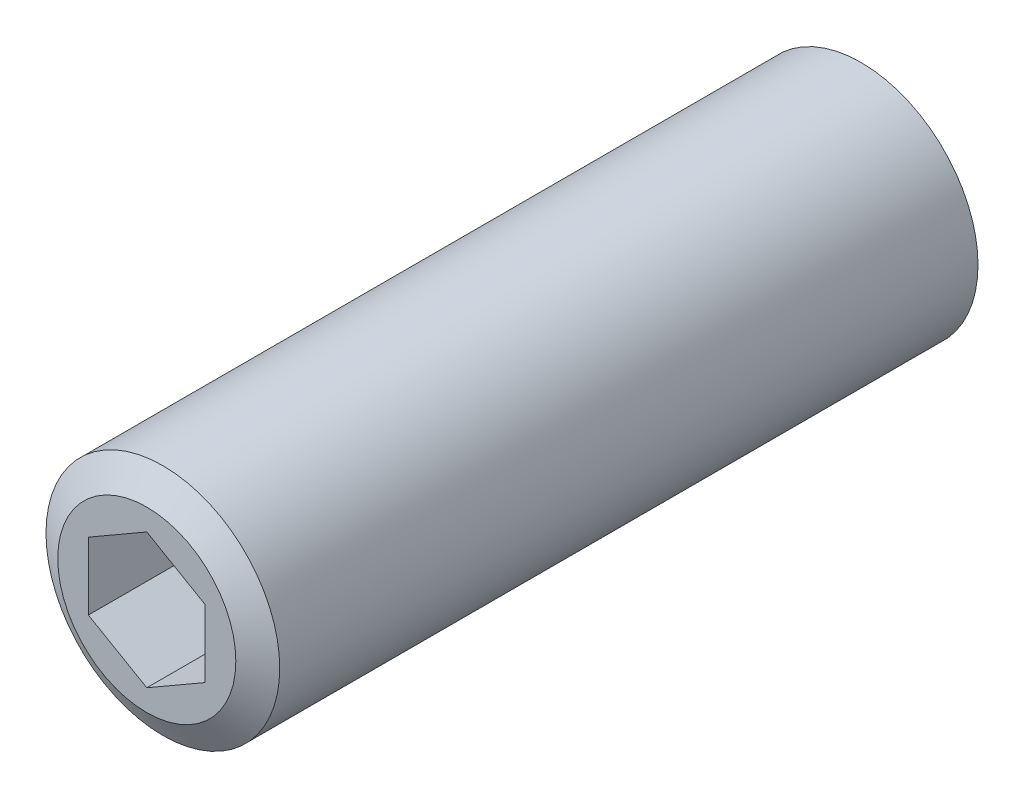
ISO-10303-21;
HEADER;
FILE_DESCRIPTION(('STEP AP214'),'2;1');
FILE_NAME('part.step','',(''),(''),'','','');
FILE_SCHEMA(('AUTOMOTIVE_DESIGN { 1 0 10303 214 1 1 1 1 }'));
ENDSEC;
DATA;
#1=APPLICATION_CONTEXT('core data for automotive mechanical design processes');
#2=APPLICATION_PROTOCOL_DEFINITION('international standard','automotive_design',2000,#1);
#3=PRODUCT_CONTEXT('',#1,'mechanical');
#4=PRODUCT('Part','Part','',(#3));
#5=PRODUCT_RELATED_PRODUCT_CATEGORY('part','',(#4));
#6=PRODUCT_DEFINITION_FORMATION('','',#4);
#7=PRODUCT_DEFINITION_CONTEXT('part definition',#1,'design');
#8=PRODUCT_DEFINITION('design','',#6,#7);
#9=PRODUCT_DEFINITION_SHAPE('','',#8);
#10=(LENGTH_UNIT() NAMED_UNIT(*) SI_UNIT(.MILLI.,.METRE.));
#11=(NAMED_UNIT(*) PLANE_ANGLE_UNIT() SI_UNIT($,.RADIAN.));
#12=(NAMED_UNIT(*) SI_UNIT($,.STERADIAN.) SOLID_ANGLE_UNIT());
#13=UNCERTAINTY_MEASURE_WITH_UNIT(LENGTH_MEASURE(1.E-05),#10,'distance_accuracy_value','');
#14=(GEOMETRIC_REPRESENTATION_CONTEXT(3) GLOBAL_UNCERTAINTY_ASSIGNED_CONTEXT((#13)) GLOBAL_UNIT_ASSIGNED_CONTEXT((#10,
#11,#12)) REPRESENTATION_CONTEXT('',''));
#15=CARTESIAN_POINT('',(0.,0.,0.));
#16=DIRECTION('',(0.,0.,1.));
#17=DIRECTION('',(1.,0.,0.));
#18=AXIS2_PLACEMENT_3D('',#15,#16,#17);
#19=CARTESIAN_POINT('',(0.,0.,0.));
#20=DIRECTION('',(0.,0.,-1.));
#21=DIRECTION('',(-1.,0.,0.));
#22=AXIS2_PLACEMENT_3D('',#19,#20,#21);
#23=PLANE('',#22);
#24=CARTESIAN_POINT('',(0.,0.,0.));
#25=DIRECTION('',(0.,0.,-1.));
#26=DIRECTION('',(-1.,0.,0.));
#27=AXIS2_PLACEMENT_3D('',#24,#25,#26);
#28=CIRCLE('',#27,4.25);
#29=CARTESIAN_POINT('',(-4.25,0.,0.));
#30=VERTEX_POINT('',#29);
#31=EDGE_CURVE('E9',#30,#30,#28,.T.);
#32=ORIENTED_EDGE('',*,*,#31,.T.);
#33=EDGE_LOOP('',(#32));
#34=FACE_BOUND('',#33,.T.);
#35=ADVANCED_FACE('F14',(#34),#23,.T.);
#36=CARTESIAN_POINT('',(0.,0.,-2.));
#37=DIRECTION('',(0.,0.,-1.));
#38=DIRECTION('',(-1.,0.,0.));
#39=AXIS2_PLACEMENT_3D('',#36,#37,#38);
#40=CYLINDRICAL_SURFACE('',#39,4.25);
#41=CARTESIAN_POINT('',(0.,0.,1.5));
#42=DIRECTION('',(0.,0.,-1.));
#43=DIRECTION('',(-1.,0.,0.));
#44=AXIS2_PLACEMENT_3D('',#41,#42,#43);
#45=CIRCLE('',#44,4.25);
#46=CARTESIAN_POINT('',(-4.25,0.,1.5));
#47=VERTEX_POINT('',#46);
#48=EDGE_CURVE('E21',#47,#47,#45,.T.);
#49=ORIENTED_EDGE('',*,*,#48,.T.);
#50=EDGE_LOOP('',(#49));
#51=FACE_BOUND('',#50,.T.);
#52=ORIENTED_EDGE('',*,*,#31,.F.);
#53=EDGE_LOOP('',(#52));
#54=FACE_BOUND('',#53,.T.);
#55=ADVANCED_FACE('F134',(#51,#54),#40,.T.);
#56=CARTESIAN_POINT('',(0.,4.25,1.5));
#57=DIRECTION('',(0.,0.,-1.));
#58=DIRECTION('',(-1.,0.,0.));
#59=AXIS2_PLACEMENT_3D('',#56,#57,#58);
#60=PLANE('',#59);
#61=CARTESIAN_POINT('',(0.,0.,1.5));
#62=DIRECTION('',(0.,0.,-1.));
#63=DIRECTION('',(-1.,0.,0.));
#64=AXIS2_PLACEMENT_3D('',#61,#62,#63);
#65=CIRCLE('',#64,6.094744);
#66=CARTESIAN_POINT('',(-6.094744,0.,1.5));
#67=VERTEX_POINT('',#66);
#68=EDGE_CURVE('E129',#67,#67,#65,.T.);
#69=ORIENTED_EDGE('',*,*,#68,.T.);
#70=EDGE_LOOP('',(#69));
#71=FACE_BOUND('',#70,.T.);
#72=ORIENTED_EDGE('',*,*,#48,.F.);
#73=EDGE_LOOP('',(#72));
#74=FACE_BOUND('',#73,.T.);
#75=ADVANCED_FACE('F137',(#71,#74),#60,.T.);
#76=CARTESIAN_POINT('',(0.,0.,1.5));
#77=DIRECTION('',(0.,0.,1.));
#78=DIRECTION('',(1.,0.,0.));
#79=AXIS2_PLACEMENT_3D('',#76,#77,#78);
#80=CONICAL_SURFACE('',#79,6.094744,1.04719757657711);
#81=CARTESIAN_POINT('',(0.,0.,2.6));
#82=DIRECTION('',(0.,0.,-1.));
#83=DIRECTION('',(-1.,0.,0.));
#84=AXIS2_PLACEMENT_3D('',#81,#82,#83);
#85=CIRCLE('',#84,8.);
#86=CARTESIAN_POINT('',(-8.,0.,2.6));
#87=VERTEX_POINT('',#86);
#88=EDGE_CURVE('E126',#87,#87,#85,.T.);
#89=ORIENTED_EDGE('',*,*,#88,.T.);
#90=EDGE_LOOP('',(#89));
#91=FACE_BOUND('',#90,.T.);
#92=ORIENTED_EDGE('',*,*,#68,.F.);
#93=EDGE_LOOP('',(#92));
#94=FACE_BOUND('',#93,.T.);
#95=ADVANCED_FACE('F139',(#91,#94),#80,.T.);
#96=CARTESIAN_POINT('',(0.,0.,-2.));
#97=DIRECTION('',(0.,0.,-1.));
#98=DIRECTION('',(-1.,0.,0.));
#99=AXIS2_PLACEMENT_3D('',#96,#97,#98);
#100=CYLINDRICAL_SURFACE('',#99,8.);
#101=CARTESIAN_POINT('',(0.,0.,50.4));
#102=DIRECTION('',(0.,0.,-1.));
#103=DIRECTION('',(-1.,0.,0.));
#104=AXIS2_PLACEMENT_3D('',#101,#102,#103);
#105=CIRCLE('',#104,8.);
#106=CARTESIAN_POINT('',(-8.,0.,50.4));
#107=VERTEX_POINT('',#106);
#108=EDGE_CURVE('E123',#107,#107,#105,.T.);
#109=ORIENTED_EDGE('',*,*,#108,.T.);
#110=EDGE_LOOP('',(#109));
#111=FACE_BOUND('',#110,.T.);
#112=ORIENTED_EDGE('',*,*,#88,.F.);
#113=EDGE_LOOP('',(#112));
#114=FACE_BOUND('',#113,.T.);
#115=ADVANCED_FACE('F148',(#111,#114),#100,.T.);
#116=CARTESIAN_POINT('',(0.,0.,50.4));
#117=DIRECTION('',(0.,0.,-1.));
#118=DIRECTION('',(-1.,0.,0.));
#119=AXIS2_PLACEMENT_3D('',#116,#117,#118);
#120=CONICAL_SURFACE('',#119,8.,1.04719757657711);
#121=CARTESIAN_POINT('',(0.,0.,51.5));
#122=DIRECTION('',(0.,0.,-1.));
#123=DIRECTION('',(-1.,0.,0.));
#124=AXIS2_PLACEMENT_3D('',#121,#122,#123);
#125=CIRCLE('',#124,6.094744);
#126=CARTESIAN_POINT('',(-6.094744,0.,51.5));
#127=VERTEX_POINT('',#126);
#128=EDGE_CURVE('E115',#127,#127,#125,.T.);
#129=ORIENTED_EDGE('',*,*,#128,.T.);
#130=EDGE_LOOP('',(#129));
#131=FACE_BOUND('',#130,.T.);
#132=ORIENTED_EDGE('',*,*,#108,.F.);
#133=EDGE_LOOP('',(#132));
#134=FACE_BOUND('',#133,.T.);
#135=ADVANCED_FACE('F187',(#131,#134),#120,.T.);
#136=CARTESIAN_POINT('',(0.,0.,51.5));
#137=DIRECTION('',(0.,0.,1.));
#138=DIRECTION('',(1.,0.,0.));
#139=AXIS2_PLACEMENT_3D('',#136,#137,#138);
#140=PLANE('',#139);
#141=DIRECTION('',(-0.866025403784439,0.5,0.));
#142=VECTOR('',#141,1.);
#143=CARTESIAN_POINT('',(4.,2.30940107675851,51.5));
#144=LINE('',#143,#142);
#145=CARTESIAN_POINT('',(4.,2.30940107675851,51.5));
#146=VERTEX_POINT('',#145);
#147=CARTESIAN_POINT('',(0.,4.61880215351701,51.5));
#148=VERTEX_POINT('',#147);
#149=EDGE_CURVE('E28',#146,#148,#144,.T.);
#150=ORIENTED_EDGE('',*,*,#149,.F.);
#151=DIRECTION('',(0.,1.,0.));
#152=VECTOR('',#151,1.);
#153=CARTESIAN_POINT('',(4.,-2.30940107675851,51.5));
#154=LINE('',#153,#152);
#155=CARTESIAN_POINT('',(4.,-2.30940107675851,51.5));
#156=VERTEX_POINT('',#155);
#157=EDGE_CURVE('E111',#156,#146,#154,.T.);
#158=ORIENTED_EDGE('',*,*,#157,.F.);
#159=DIRECTION('',(0.866025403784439,0.5,0.));
#160=VECTOR('',#159,1.);
#161=CARTESIAN_POINT('',(0.,-4.61880215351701,51.5));
#162=LINE('',#161,#160);
#163=CARTESIAN_POINT('',(0.,-4.61880215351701,51.5));
#164=VERTEX_POINT('',#163);
#165=EDGE_CURVE('E109',#164,#156,#162,.T.);
#166=ORIENTED_EDGE('',*,*,#165,.F.);
#167=DIRECTION('',(0.866025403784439,-0.5,0.));
#168=VECTOR('',#167,1.);
#169=CARTESIAN_POINT('',(-4.,-2.30940107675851,51.5));
#170=LINE('',#169,#168);
#171=CARTESIAN_POINT('',(-4.,-2.30940107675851,51.5));
#172=VERTEX_POINT('',#171);
#173=EDGE_CURVE('E76',#172,#164,#170,.T.);
#174=ORIENTED_EDGE('',*,*,#173,.F.);
#175=DIRECTION('',(0.,-1.,0.));
#176=VECTOR('',#175,1.);
#177=CARTESIAN_POINT('',(-4.,2.30940107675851,51.5));
#178=LINE('',#177,#176);
#179=CARTESIAN_POINT('',(-4.,2.30940107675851,51.5));
#180=VERTEX_POINT('',#179);
#181=EDGE_CURVE('E105',#180,#172,#178,.T.);
#182=ORIENTED_EDGE('',*,*,#181,.F.);
#183=DIRECTION('',(-0.866025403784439,-0.5,0.));
#184=VECTOR('',#183,1.);
#185=CARTESIAN_POINT('',(0.,4.61880215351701,51.5));
#186=LINE('',#185,#184);
#187=EDGE_CURVE('E102',#148,#180,#186,.T.);
#188=ORIENTED_EDGE('',*,*,#187,.F.);
#189=EDGE_LOOP('',(#150,#158,#166,#174,#182,#188));
#190=FACE_BOUND('',#189,.T.);
#191=ORIENTED_EDGE('',*,*,#128,.F.);
#192=EDGE_LOOP('',(#191));
#193=FACE_BOUND('',#192,.T.);
#194=ADVANCED_FACE('F195',(#190,#193),#140,.T.);
#195=CARTESIAN_POINT('',(4.,2.30940107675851,45.5));
#196=DIRECTION('',(0.5,0.866025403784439,0.));
#197=DIRECTION('',(-0.866025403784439,0.5,0.));
#198=AXIS2_PLACEMENT_3D('',#195,#196,#197);
#199=PLANE('',#198);
#200=ORIENTED_EDGE('',*,*,#149,.T.);
#201=DIRECTION('',(0.,0.,1.));
#202=VECTOR('',#201,1.);
#203=CARTESIAN_POINT('',(0.,4.61880215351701,45.5));
#204=LINE('',#203,#202);
#205=CARTESIAN_POINT('',(0.,4.61880215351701,45.5));
#206=VERTEX_POINT('',#205);
#207=EDGE_CURVE('E58',#206,#148,#204,.T.);
#208=ORIENTED_EDGE('',*,*,#207,.F.);
#209=DIRECTION('',(-0.866025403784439,0.5,0.));
#210=VECTOR('',#209,1.);
#211=CARTESIAN_POINT('',(4.,2.30940107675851,45.5));
#212=LINE('',#211,#210);
#213=CARTESIAN_POINT('',(4.,2.30940107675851,45.5));
#214=VERTEX_POINT('',#213);
#215=EDGE_CURVE('E113',#214,#206,#212,.T.);
#216=ORIENTED_EDGE('',*,*,#215,.F.);
#217=DIRECTION('',(0.,0.,1.));
#218=VECTOR('',#217,1.);
#219=CARTESIAN_POINT('',(4.,2.30940107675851,45.5));
#220=LINE('',#219,#218);
#221=EDGE_CURVE('E36',#214,#146,#220,.T.);
#222=ORIENTED_EDGE('',*,*,#221,.T.);
#223=EDGE_LOOP('',(#200,#208,#216,#222));
#224=FACE_BOUND('',#223,.T.);
#225=ADVANCED_FACE('F204',(#224),#199,.F.);
#226=CARTESIAN_POINT('',(4.,-2.30940107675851,45.5));
#227=DIRECTION('',(1.,0.,0.));
#228=DIRECTION('',(0.,0.,-1.));
#229=AXIS2_PLACEMENT_3D('',#226,#227,#228);
#230=PLANE('',#229);
#231=ORIENTED_EDGE('',*,*,#157,.T.);
#232=ORIENTED_EDGE('',*,*,#221,.F.);
#233=DIRECTION('',(0.,1.,0.));
#234=VECTOR('',#233,1.);
#235=CARTESIAN_POINT('',(4.,-2.30940107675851,45.5));
#236=LINE('',#235,#234);
#237=CARTESIAN_POINT('',(4.,-2.30940107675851,45.5));
#238=VERTEX_POINT('',#237);
#239=EDGE_CURVE('E88',#238,#214,#236,.T.);
#240=ORIENTED_EDGE('',*,*,#239,.F.);
#241=DIRECTION('',(0.,0.,1.));
#242=VECTOR('',#241,1.);
#243=CARTESIAN_POINT('',(4.,-2.30940107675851,45.5));
#244=LINE('',#243,#242);
#245=EDGE_CURVE('E80',#238,#156,#244,.T.);
#246=ORIENTED_EDGE('',*,*,#245,.T.);
#247=EDGE_LOOP('',(#231,#232,#240,#246));
#248=FACE_BOUND('',#247,.T.);
#249=ADVANCED_FACE('F213',(#248),#230,.F.);
#250=CARTESIAN_POINT('',(0.,-4.61880215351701,45.5));
#251=DIRECTION('',(0.5,-0.866025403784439,0.));
#252=DIRECTION('',(0.866025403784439,0.5,0.));
#253=AXIS2_PLACEMENT_3D('',#250,#251,#252);
#254=PLANE('',#253);
#255=ORIENTED_EDGE('',*,*,#165,.T.);
#256=ORIENTED_EDGE('',*,*,#245,.F.);
#257=DIRECTION('',(0.866025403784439,0.5,0.));
#258=VECTOR('',#257,1.);
#259=CARTESIAN_POINT('',(0.,-4.61880215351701,45.5));
#260=LINE('',#259,#258);
#261=CARTESIAN_POINT('',(0.,-4.61880215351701,45.5));
#262=VERTEX_POINT('',#261);
#263=EDGE_CURVE('E84',#262,#238,#260,.T.);
#264=ORIENTED_EDGE('',*,*,#263,.F.);
#265=DIRECTION('',(0.,0.,1.));
#266=VECTOR('',#265,1.);
#267=CARTESIAN_POINT('',(0.,-4.61880215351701,45.5));
#268=LINE('',#267,#266);
#269=EDGE_CURVE('E69',#262,#164,#268,.T.);
#270=ORIENTED_EDGE('',*,*,#269,.T.);
#271=EDGE_LOOP('',(#255,#256,#264,#270));
#272=FACE_BOUND('',#271,.T.);
#273=ADVANCED_FACE('F85',(#272),#254,.F.);
#274=CARTESIAN_POINT('',(-4.,-2.30940107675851,45.5));
#275=DIRECTION('',(-0.5,-0.866025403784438,0.));
#276=DIRECTION('',(0.866025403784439,-0.5,0.));
#277=AXIS2_PLACEMENT_3D('',#274,#275,#276);
#278=PLANE('',#277);
#279=ORIENTED_EDGE('',*,*,#173,.T.);
#280=ORIENTED_EDGE('',*,*,#269,.F.);
#281=DIRECTION('',(0.866025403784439,-0.5,0.));
#282=VECTOR('',#281,1.);
#283=CARTESIAN_POINT('',(-4.,-2.30940107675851,45.5));
#284=LINE('',#283,#282);
#285=CARTESIAN_POINT('',(-4.,-2.30940107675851,45.5));
#286=VERTEX_POINT('',#285);
#287=EDGE_CURVE('E73',#286,#262,#284,.T.);
#288=ORIENTED_EDGE('',*,*,#287,.F.);
#289=DIRECTION('',(0.,0.,1.));
#290=VECTOR('',#289,1.);
#291=CARTESIAN_POINT('',(-4.,-2.30940107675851,45.5));
#292=LINE('',#291,#290);
#293=EDGE_CURVE('E81',#286,#172,#292,.T.);
#294=ORIENTED_EDGE('',*,*,#293,.T.);
#295=EDGE_LOOP('',(#279,#280,#288,#294));
#296=FACE_BOUND('',#295,.T.);
#297=ADVANCED_FACE('F71',(#296),#278,.F.);
#298=CARTESIAN_POINT('',(-4.,2.30940107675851,45.5));
#299=DIRECTION('',(-1.,0.,0.));
#300=DIRECTION('',(0.,0.,1.));
#301=AXIS2_PLACEMENT_3D('',#298,#299,#300);
#302=PLANE('',#301);
#303=ORIENTED_EDGE('',*,*,#181,.T.);
#304=ORIENTED_EDGE('',*,*,#293,.F.);
#305=DIRECTION('',(0.,-1.,0.));
#306=VECTOR('',#305,1.);
#307=CARTESIAN_POINT('',(-4.,2.30940107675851,45.5));
#308=LINE('',#307,#306);
#309=CARTESIAN_POINT('',(-4.,2.30940107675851,45.5));
#310=VERTEX_POINT('',#309);
#311=EDGE_CURVE('E94',#310,#286,#308,.T.);
#312=ORIENTED_EDGE('',*,*,#311,.F.);
#313=DIRECTION('',(0.,0.,1.));
#314=VECTOR('',#313,1.);
#315=CARTESIAN_POINT('',(-4.,2.30940107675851,45.5));
#316=LINE('',#315,#314);
#317=EDGE_CURVE('E118',#310,#180,#316,.T.);
#318=ORIENTED_EDGE('',*,*,#317,.T.);
#319=EDGE_LOOP('',(#303,#304,#312,#318));
#320=FACE_BOUND('',#319,.T.);
#321=ADVANCED_FACE('F235',(#320),#302,.F.);
#322=CARTESIAN_POINT('',(0.,4.61880215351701,45.5));
#323=DIRECTION('',(-0.5,0.866025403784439,0.));
#324=DIRECTION('',(-0.866025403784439,-0.5,0.));
#325=AXIS2_PLACEMENT_3D('',#322,#323,#324);
#326=PLANE('',#325);
#327=ORIENTED_EDGE('',*,*,#187,.T.);
#328=ORIENTED_EDGE('',*,*,#317,.F.);
#329=DIRECTION('',(-0.866025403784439,-0.5,0.));
#330=VECTOR('',#329,1.);
#331=CARTESIAN_POINT('',(0.,4.61880215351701,45.5));
#332=LINE('',#331,#330);
#333=EDGE_CURVE('E96',#206,#310,#332,.T.);
#334=ORIENTED_EDGE('',*,*,#333,.F.);
#335=ORIENTED_EDGE('',*,*,#207,.T.);
#336=EDGE_LOOP('',(#327,#328,#334,#335));
#337=FACE_BOUND('',#336,.T.);
#338=ADVANCED_FACE('F243',(#337),#326,.F.);
#339=CARTESIAN_POINT('',(0.,4.61880215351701,45.5));
#340=DIRECTION('',(0.,0.,1.));
#341=DIRECTION('',(1.,0.,0.));
#342=AXIS2_PLACEMENT_3D('',#339,#340,#341);
#343=PLANE('',#342);
#344=ORIENTED_EDGE('',*,*,#215,.T.);
#345=ORIENTED_EDGE('',*,*,#333,.T.);
#346=ORIENTED_EDGE('',*,*,#311,.T.);
#347=ORIENTED_EDGE('',*,*,#287,.T.);
#348=ORIENTED_EDGE('',*,*,#263,.T.);
#349=ORIENTED_EDGE('',*,*,#239,.T.);
#350=EDGE_LOOP('',(#344,#345,#346,#347,#348,#349));
#351=FACE_BOUND('',#350,.T.);
#352=ADVANCED_FACE('F91',(#351),#343,.T.);
#353=CLOSED_SHELL('',(#35,#55,#75,#95,#115,#135,#194,#225,#249,#273,#297,#321,#338,#352));
#354=MANIFOLD_SOLID_BREP('B1',#353);
#355=ADVANCED_BREP_SHAPE_REPRESENTATION('',(#18,#354),#14);
#356=SHAPE_DEFINITION_REPRESENTATION(#9,#355);
ENDSEC;
END-ISO-10303-21;
